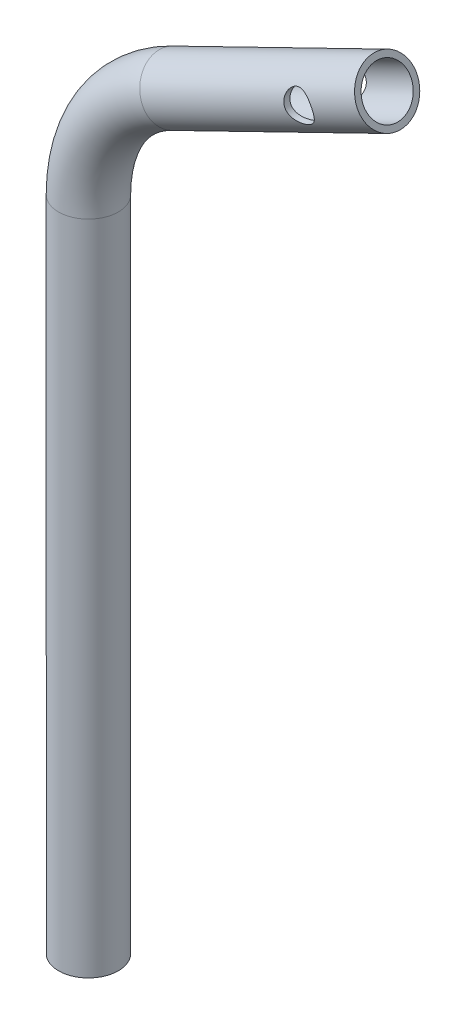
ISO-10303-21;
HEADER;
FILE_DESCRIPTION(('STEP AP214'),'2;1');
FILE_NAME('part.step','',(''),(''),'','','');
FILE_SCHEMA(('AUTOMOTIVE_DESIGN { 1 0 10303 214 1 1 1 1 }'));
ENDSEC;
DATA;
#1=APPLICATION_CONTEXT('core data for automotive mechanical design processes');
#2=APPLICATION_PROTOCOL_DEFINITION('international standard','automotive_design',2000,#1);
#3=PRODUCT_CONTEXT('',#1,'mechanical');
#4=PRODUCT('Part','Part','',(#3));
#5=PRODUCT_RELATED_PRODUCT_CATEGORY('part','',(#4));
#6=PRODUCT_DEFINITION_FORMATION('','',#4);
#7=PRODUCT_DEFINITION_CONTEXT('part definition',#1,'design');
#8=PRODUCT_DEFINITION('design','',#6,#7);
#9=PRODUCT_DEFINITION_SHAPE('','',#8);
#10=(LENGTH_UNIT() NAMED_UNIT(*) SI_UNIT(.MILLI.,.METRE.));
#11=(NAMED_UNIT(*) PLANE_ANGLE_UNIT() SI_UNIT($,.RADIAN.));
#12=(NAMED_UNIT(*) SI_UNIT($,.STERADIAN.) SOLID_ANGLE_UNIT());
#13=UNCERTAINTY_MEASURE_WITH_UNIT(LENGTH_MEASURE(1.E-05),#10,'distance_accuracy_value','');
#14=(GEOMETRIC_REPRESENTATION_CONTEXT(3) GLOBAL_UNCERTAINTY_ASSIGNED_CONTEXT((#13)) GLOBAL_UNIT_ASSIGNED_CONTEXT((#10,
#11,#12)) REPRESENTATION_CONTEXT('',''));
#15=CARTESIAN_POINT('',(0.,0.,0.));
#16=DIRECTION('',(0.,0.,1.));
#17=DIRECTION('',(1.,0.,0.));
#18=AXIS2_PLACEMENT_3D('',#15,#16,#17);
#19=CARTESIAN_POINT('',(28.0898876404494,264.943820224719,0.));
#20=DIRECTION('',(0.898876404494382,0.438202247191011,0.));
#21=DIRECTION('',(-0.438202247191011,0.898876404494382,0.));
#22=AXIS2_PLACEMENT_3D('',#19,#20,#21);
#23=CYLINDRICAL_SURFACE('',#22,10.);
#24=CARTESIAN_POINT('',(84.7191011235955,292.550561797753,-10.));
#25=CARTESIAN_POINT('',(84.7767194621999,292.43236934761,-9.99999960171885));
#26=CARTESIAN_POINT('',(84.829674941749,292.311893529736,-9.99740053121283));
#27=CARTESIAN_POINT('',(84.9258801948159,292.06728786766,-9.98706977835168));
#28=CARTESIAN_POINT('',(84.96912573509,291.943156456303,-9.97933586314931));
#29=CARTESIAN_POINT('',(85.0456773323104,291.692071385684,-9.95892066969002));
#30=CARTESIAN_POINT('',(85.0789690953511,291.565113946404,-9.94623233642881));
#31=CARTESIAN_POINT('',(85.1354042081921,291.309455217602,-9.91622716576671));
#32=CARTESIAN_POINT('',(85.1585433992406,291.180753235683,-9.89890843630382));
#33=CARTESIAN_POINT('',(85.19455126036,290.923118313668,-9.86015430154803));
#34=CARTESIAN_POINT('',(85.2074640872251,290.794188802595,-9.83873709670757));
#35=CARTESIAN_POINT('',(85.2232632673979,290.536358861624,-9.79224427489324));
#36=CARTESIAN_POINT('',(85.2261458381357,290.407458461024,-9.7671672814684));
#37=CARTESIAN_POINT('',(85.2199194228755,290.022109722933,-9.68730860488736));
#38=CARTESIAN_POINT('',(85.1959751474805,289.766729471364,-9.62785460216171));
#39=CARTESIAN_POINT('',(85.1073844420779,289.249291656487,-9.49780663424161));
#40=CARTESIAN_POINT('',(85.0403632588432,288.987764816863,-9.42675632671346));
#41=CARTESIAN_POINT('',(84.8654409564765,288.479084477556,-9.28300214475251));
#42=CARTESIAN_POINT('',(84.7575088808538,288.231942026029,-9.2102970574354));
#43=CARTESIAN_POINT('',(84.4924388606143,287.738323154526,-9.06493867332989));
#44=CARTESIAN_POINT('',(84.3321341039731,287.493384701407,-8.99272664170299));
#45=CARTESIAN_POINT('',(84.0598726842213,287.14814049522,-8.89637417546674));
#46=CARTESIAN_POINT('',(83.9637803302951,287.036719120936,-8.86624279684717));
#47=CARTESIAN_POINT('',(83.7614600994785,286.822155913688,-8.81109611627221));
#48=CARTESIAN_POINT('',(83.655238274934,286.719009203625,-8.78607778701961));
#49=CARTESIAN_POINT('',(83.4399209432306,286.527845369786,-8.74350562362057));
#50=CARTESIAN_POINT('',(83.3313696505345,286.439293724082,-8.72559704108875));
#51=CARTESIAN_POINT('',(83.1067106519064,286.271301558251,-8.69596333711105));
#52=CARTESIAN_POINT('',(82.9906069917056,286.191856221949,-8.6842349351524));
#53=CARTESIAN_POINT('',(82.7518296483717,286.042896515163,-8.66746161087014));
#54=CARTESIAN_POINT('',(82.6291599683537,285.973376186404,-8.66241266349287));
#55=CARTESIAN_POINT('',(82.3783175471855,285.844922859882,-8.65921299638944));
#56=CARTESIAN_POINT('',(82.2501453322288,285.785988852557,-8.66106161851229));
#57=CARTESIAN_POINT('',(82.0051750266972,285.685650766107,-8.67093727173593));
#58=CARTESIAN_POINT('',(81.8888566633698,285.642991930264,-8.6781966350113));
#59=CARTESIAN_POINT('',(81.6537249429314,285.566510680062,-8.69773906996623));
#60=CARTESIAN_POINT('',(81.5349108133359,285.532691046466,-8.71002371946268));
#61=CARTESIAN_POINT('',(81.2956620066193,285.474036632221,-8.73921479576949));
#62=CARTESIAN_POINT('',(81.1752275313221,285.449200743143,-8.7561206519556));
#63=CARTESIAN_POINT('',(80.933472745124,285.408518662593,-8.79403073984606));
#64=CARTESIAN_POINT('',(80.8121521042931,285.392676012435,-8.81503658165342));
#65=CARTESIAN_POINT('',(80.4423800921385,285.358076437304,-8.88436032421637));
#66=CARTESIAN_POINT('',(80.1935051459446,285.353561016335,-8.93828791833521));
#67=CARTESIAN_POINT('',(79.7000655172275,285.381001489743,-9.05517433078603));
#68=CARTESIAN_POINT('',(79.4555028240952,285.412973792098,-9.11813720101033));
#69=CARTESIAN_POINT('',(78.9440038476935,285.518443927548,-9.2556545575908));
#70=CARTESIAN_POINT('',(78.6781626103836,285.596693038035,-9.33066654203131));
#71=CARTESIAN_POINT('',(78.161970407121,285.79648099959,-9.47739013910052));
#72=CARTESIAN_POINT('',(77.9116268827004,285.918040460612,-9.54910016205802));
#73=CARTESIAN_POINT('',(77.5468838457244,286.134565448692,-9.65034506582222));
#74=CARTESIAN_POINT('',(77.4245114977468,286.214634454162,-9.68370380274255));
#75=CARTESIAN_POINT('',(77.1866410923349,286.385696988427,-9.74663052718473));
#76=CARTESIAN_POINT('',(77.0711401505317,286.476685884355,-9.77620011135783));
#77=CARTESIAN_POINT('',(76.8480402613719,286.669058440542,-9.83067553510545));
#78=CARTESIAN_POINT('',(76.7404381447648,286.770437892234,-9.85558325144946));
#79=CARTESIAN_POINT('',(76.5341187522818,286.982955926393,-9.89999026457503));
#80=CARTESIAN_POINT('',(76.4354004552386,287.0940933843,-9.91949018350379));
#81=CARTESIAN_POINT('',(76.2556453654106,287.315689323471,-9.95109597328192));
#82=CARTESIAN_POINT('',(76.1738213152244,287.425441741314,-9.96368046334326));
#83=CARTESIAN_POINT('',(76.0192589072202,287.651624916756,-9.98343035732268));
#84=CARTESIAN_POINT('',(75.9465197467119,287.768055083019,-9.99059624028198));
#85=CARTESIAN_POINT('',(75.8108153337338,288.006620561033,-9.99930380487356));
#86=CARTESIAN_POINT('',(75.7478463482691,288.12875367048,-10.000847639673));
#87=CARTESIAN_POINT('',(75.6321976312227,288.377736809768,-9.99827237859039));
#88=CARTESIAN_POINT('',(75.5795174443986,288.504586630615,-9.99415353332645));
#89=CARTESIAN_POINT('',(75.4885354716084,288.751896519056,-9.98090973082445));
#90=CARTESIAN_POINT('',(75.4494338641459,288.872085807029,-9.97219922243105));
#91=CARTESIAN_POINT('',(75.3805122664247,289.114731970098,-9.95027227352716));
#92=CARTESIAN_POINT('',(75.3506952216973,289.237189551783,-9.93705440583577));
#93=CARTESIAN_POINT('',(75.30046758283,289.48346236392,-9.90642450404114));
#94=CARTESIAN_POINT('',(75.2800541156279,289.607277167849,-9.88901375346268));
#95=CARTESIAN_POINT('',(75.2486129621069,289.855519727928,-9.85039368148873));
#96=CARTESIAN_POINT('',(75.2375888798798,289.979947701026,-9.82918290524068));
#97=CARTESIAN_POINT('',(75.2181796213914,290.360025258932,-9.7592287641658));
#98=CARTESIAN_POINT('',(75.2248521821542,290.615603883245,-9.70504904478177));
#99=CARTESIAN_POINT('',(75.276434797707,291.120496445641,-9.58719375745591));
#100=CARTESIAN_POINT('',(75.3213611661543,291.36980766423,-9.5235141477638));
#101=CARTESIAN_POINT('',(75.4540331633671,291.881779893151,-9.38541505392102));
#102=CARTESIAN_POINT('',(75.5455504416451,292.143347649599,-9.31055499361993));
#103=CARTESIAN_POINT('',(75.7709065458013,292.648670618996,-9.16310881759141));
#104=CARTESIAN_POINT('',(75.904774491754,292.892413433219,-9.0905243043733));
#105=CARTESIAN_POINT('',(76.1392977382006,293.245842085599,-8.98785260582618));
#106=CARTESIAN_POINT('',(76.2255127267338,293.364197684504,-8.95395955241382));
#107=CARTESIAN_POINT('',(76.4085782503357,293.593520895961,-8.89022352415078));
#108=CARTESIAN_POINT('',(76.5054239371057,293.704491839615,-8.86037871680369));
#109=CARTESIAN_POINT('',(76.7091652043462,293.918011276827,-8.80590327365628));
#110=CARTESIAN_POINT('',(76.8160524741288,294.020566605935,-8.78126837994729));
#111=CARTESIAN_POINT('',(77.0392351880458,294.216325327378,-8.73822819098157));
#112=CARTESIAN_POINT('',(77.155529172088,294.309530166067,-8.7198219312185));
#113=CARTESIAN_POINT('',(77.3850022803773,294.477100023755,-8.69151275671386));
#114=CARTESIAN_POINT('',(77.4974091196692,294.552414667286,-8.6809632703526));
#115=CARTESIAN_POINT('',(77.7282607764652,294.693833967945,-8.66606824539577));
#116=CARTESIAN_POINT('',(77.8467049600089,294.759939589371,-8.66172205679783));
#117=CARTESIAN_POINT('',(78.0885822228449,294.882302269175,-8.65941425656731));
#118=CARTESIAN_POINT('',(78.2120135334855,294.938562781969,-8.66145040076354));
#119=CARTESIAN_POINT('',(78.4628043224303,295.040788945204,-8.67181681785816));
#120=CARTESIAN_POINT('',(78.5901636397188,295.086755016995,-8.68014683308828));
#121=CARTESIAN_POINT('',(78.8353765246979,295.164198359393,-8.70167828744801));
#122=CARTESIAN_POINT('',(78.9529744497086,295.19664081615,-8.71433770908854));
#123=CARTESIAN_POINT('',(79.1896976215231,295.252765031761,-8.74411599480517));
#124=CARTESIAN_POINT('',(79.308823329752,295.276444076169,-8.76123623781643));
#125=CARTESIAN_POINT('',(79.6673387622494,295.334269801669,-8.81854231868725));
#126=CARTESIAN_POINT('',(79.9080213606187,295.35525342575,-8.8646881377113));
#127=CARTESIAN_POINT('',(80.4034722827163,295.362909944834,-8.97142890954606));
#128=CARTESIAN_POINT('',(80.6581005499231,295.3471829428,-9.03278633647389));
#129=CARTESIAN_POINT('',(81.1605585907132,295.277736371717,-9.1617663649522));
#130=CARTESIAN_POINT('',(81.4083847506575,295.223996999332,-9.22939221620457));
#131=CARTESIAN_POINT('',(81.9225455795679,295.071009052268,-9.3731144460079));
#132=CARTESIAN_POINT('',(82.1874702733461,294.967024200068,-9.44924162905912));
#133=CARTESIAN_POINT('',(82.6978464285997,294.714385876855,-9.59389514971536));
#134=CARTESIAN_POINT('',(82.9432873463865,294.565708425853,-9.66241737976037));
#135=CARTESIAN_POINT('',(83.2920945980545,294.310783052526,-9.75419013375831));
#136=CARTESIAN_POINT('',(83.4055664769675,294.220047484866,-9.78304209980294));
#137=CARTESIAN_POINT('',(83.6247536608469,294.028462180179,-9.83614745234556));
#138=CARTESIAN_POINT('',(83.7304727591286,293.927617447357,-9.86040309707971));
#139=CARTESIAN_POINT('',(83.9329497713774,293.716686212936,-9.90354484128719));
#140=CARTESIAN_POINT('',(84.0297269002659,293.606620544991,-9.92244264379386));
#141=CARTESIAN_POINT('',(84.2135590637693,293.377936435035,-9.95434618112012));
#142=CARTESIAN_POINT('',(84.3006200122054,293.259323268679,-9.96735551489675));
#143=CARTESIAN_POINT('',(84.4449363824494,293.043290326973,-9.98476387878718));
#144=CARTESIAN_POINT('',(84.5043902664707,292.947433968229,-9.99046741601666));
#145=CARTESIAN_POINT('',(84.6167419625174,292.751799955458,-9.99808569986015));
#146=CARTESIAN_POINT('',(84.6696395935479,292.652022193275,-10.000000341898));
#147=CARTESIAN_POINT('',(84.7191011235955,292.550561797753,-10.));
#148=B_SPLINE_CURVE_WITH_KNOTS('',3,(#24,#25,#26,#27,#28,#29,#30,#31,#32,#33,#34,#35,#36,#37,
#38,#39,#40,#41,#42,#43,#44,#45,#46,#47,#48,#49,#50,#51,#52,#53,#54,#55,#56,#57,#58,#59,#60,#61,
#62,#63,#64,#65,#66,#67,#68,#69,#70,#71,#72,#73,#74,#75,#76,#77,#78,#79,#80,#81,#82,#83,#84,#85,
#86,#87,#88,#89,#90,#91,#92,#93,#94,#95,#96,#97,#98,#99,#100,#101,#102,#103,#104,#105,#106,#107,
#108,#109,#110,#111,#112,#113,#114,#115,#116,#117,#118,#119,#120,#121,#122,#123,#124,#125,#126,
#127,#128,#129,#130,#131,#132,#133,#134,#135,#136,#137,#138,#139,#140,#141,#142,#143,#144,#145,
#146,#147),.UNSPECIFIED.,.T.,.F.,(4,2,2,2,2,2,2,2,2,2,2,2,2,2,2,2,2,2,2,2,2,2,2,2,2,2,2,2,2,2,2,
2,2,2,2,2,2,2,2,2,2,2,2,2,2,2,2,2,2,2,2,2,2,2,2,2,2,2,2,2,2,4),(0.,0.394355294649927,
0.788882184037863,1.18397293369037,1.57922537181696,1.97276168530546,2.3664463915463,
3.15295441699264,3.98704440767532,4.82176680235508,5.72122193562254,6.17125359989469,
6.62101803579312,7.04410338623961,7.46696393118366,7.88956954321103,8.31213483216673,
8.68401534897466,9.05601271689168,9.42796417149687,9.80006198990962,10.5608338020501,
11.3219478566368,12.1795688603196,13.03759852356,13.4870830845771,13.9363776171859,
14.3854908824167,14.8345524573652,15.2464230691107,15.6582572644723,16.0699337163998,
16.4815919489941,16.8612200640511,17.240968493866,17.6206008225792,18.0003788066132,
18.7808755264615,19.5617052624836,20.419213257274,21.2773121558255,21.7277011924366,
22.1778856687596,22.6277007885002,23.0774462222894,23.484026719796,23.8905646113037,
24.2969595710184,24.7033378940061,25.0708552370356,25.4384863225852,26.17326624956,
26.9574126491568,27.7419678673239,28.6218519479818,29.5022089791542,29.9460734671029,
30.3897193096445,30.8323885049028,31.2747867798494,31.6133053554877,31.9518332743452),.UNSPECIFIED.);
#149=CARTESIAN_POINT('',(84.7191011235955,292.550561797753,-10.));
#150=VERTEX_POINT('',#149);
#151=EDGE_CURVE('E76',#150,#150,#148,.T.);
#152=ORIENTED_EDGE('',*,*,#151,.F.);
#153=EDGE_LOOP('',(#152));
#154=FACE_BOUND('',#153,.T.);
#155=CARTESIAN_POINT('',(85.2247191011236,290.359550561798,9.75702156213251));
#156=CARTESIAN_POINT('',(85.2247095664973,290.613845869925,9.80834342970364));
#157=CARTESIAN_POINT('',(85.205269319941,290.869586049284,9.85339160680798));
#158=CARTESIAN_POINT('',(85.1267380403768,291.377529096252,9.926794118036));
#159=CARTESIAN_POINT('',(85.0676279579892,291.629730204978,9.95514041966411));
#160=CARTESIAN_POINT('',(84.9103046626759,292.123805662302,9.99238574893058));
#161=CARTESIAN_POINT('',(84.8120103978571,292.365657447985,10.0012442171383));
#162=CARTESIAN_POINT('',(84.5790149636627,292.830945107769,9.99847224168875));
#163=CARTESIAN_POINT('',(84.4443212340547,293.054384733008,9.9868459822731));
#164=CARTESIAN_POINT('',(84.1475205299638,293.470000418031,9.94495903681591));
#165=CARTESIAN_POINT('',(83.98636355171,293.662916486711,9.91527131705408));
#166=CARTESIAN_POINT('',(83.6388311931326,294.020990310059,9.84049056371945));
#167=CARTESIAN_POINT('',(83.4524499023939,294.186141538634,9.79539391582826));
#168=CARTESIAN_POINT('',(83.0494736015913,294.493335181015,9.691049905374));
#169=CARTESIAN_POINT('',(82.8318286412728,294.633791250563,9.6312033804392));
#170=CARTESIAN_POINT('',(82.3792344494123,294.878883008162,9.50393257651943));
#171=CARTESIAN_POINT('',(82.1442759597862,294.983499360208,9.43650423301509));
#172=CARTESIAN_POINT('',(81.6375864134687,295.164048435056,9.29298866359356));
#173=CARTESIAN_POINT('',(81.3645222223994,295.236093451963,9.21670723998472));
#174=CARTESIAN_POINT('',(80.808269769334,295.333390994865,9.07002524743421));
#175=CARTESIAN_POINT('',(80.5250771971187,295.358623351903,8.99962722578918));
#176=CARTESIAN_POINT('',(80.0950465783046,295.359986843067,8.90438740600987));
#177=CARTESIAN_POINT('',(79.9492915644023,295.354102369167,8.87410940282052));
#178=CARTESIAN_POINT('',(79.6579480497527,295.329470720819,8.81848577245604));
#179=CARTESIAN_POINT('',(79.5123595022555,295.3107299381,8.7931377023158));
#180=CARTESIAN_POINT('',(79.2226557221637,295.260312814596,8.74843200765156));
#181=CARTESIAN_POINT('',(79.0785391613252,295.228649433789,8.72906841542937));
#182=CARTESIAN_POINT('',(78.7929767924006,295.152455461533,8.69716627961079));
#183=CARTESIAN_POINT('',(78.6515305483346,295.107926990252,8.6846266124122));
#184=CARTESIAN_POINT('',(78.3889277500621,295.01219269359,8.66799166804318));
#185=CARTESIAN_POINT('',(78.2673200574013,294.962359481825,8.66308594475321));
#186=CARTESIAN_POINT('',(78.0283338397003,294.853228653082,8.65926051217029));
#187=CARTESIAN_POINT('',(77.9109550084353,294.793931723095,8.66034036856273));
#188=CARTESIAN_POINT('',(77.68139992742,294.66637882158,8.66844378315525));
#189=CARTESIAN_POINT('',(77.5692233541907,294.598123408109,8.67546697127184));
#190=CARTESIAN_POINT('',(77.350929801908,294.453264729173,8.6951847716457));
#191=CARTESIAN_POINT('',(77.2448127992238,294.376661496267,8.70787936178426));
#192=CARTESIAN_POINT('',(77.0461848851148,294.22112513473,8.73745617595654));
#193=CARTESIAN_POINT('',(76.953238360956,294.142683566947,8.75400478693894));
#194=CARTESIAN_POINT('',(76.7737195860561,293.979677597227,8.79113421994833));
#195=CARTESIAN_POINT('',(76.6871494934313,293.895111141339,8.81171639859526));
#196=CARTESIAN_POINT('',(76.4376353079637,293.63309524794,8.8786547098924));
#197=CARTESIAN_POINT('',(76.2847636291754,293.447231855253,8.93022227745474));
#198=CARTESIAN_POINT('',(75.9951402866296,293.038951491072,9.04742769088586));
#199=CARTESIAN_POINT('',(75.8612938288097,292.814739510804,9.11393626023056));
#200=CARTESIAN_POINT('',(75.6302613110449,292.349171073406,9.25077256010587));
#201=CARTESIAN_POINT('',(75.5330988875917,292.10780368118,9.32110271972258));
#202=CARTESIAN_POINT('',(75.3687541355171,291.585246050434,9.46671719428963));
#203=CARTESIAN_POINT('',(75.3059353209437,291.302568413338,9.54171776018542));
#204=CARTESIAN_POINT('',(75.2489194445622,290.871874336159,9.64579855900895));
#205=CARTESIAN_POINT('',(75.2361194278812,290.727115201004,9.67910482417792));
#206=CARTESIAN_POINT('',(75.2231923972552,290.436254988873,9.74201512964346));
#207=CARTESIAN_POINT('',(75.2230589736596,290.290154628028,9.77162103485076));
#208=CARTESIAN_POINT('',(75.2355312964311,290.001196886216,9.82561919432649));
#209=CARTESIAN_POINT('',(75.2478292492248,289.858346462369,9.85012015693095));
#210=CARTESIAN_POINT('',(75.2848023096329,289.573530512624,9.89407884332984));
#211=CARTESIAN_POINT('',(75.3094713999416,289.431564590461,9.91353901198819));
#212=CARTESIAN_POINT('',(75.3711490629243,289.14973392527,9.94684010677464));
#213=CARTESIAN_POINT('',(75.4081516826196,289.009868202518,9.96068373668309));
#214=CARTESIAN_POINT('',(75.4943107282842,288.733455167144,9.98233448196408));
#215=CARTESIAN_POINT('',(75.5434658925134,288.596907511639,9.99014222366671));
#216=CARTESIAN_POINT('',(75.648010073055,288.341936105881,9.99900715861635));
#217=CARTESIAN_POINT('',(75.7022751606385,288.223070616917,10.0006642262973));
#218=CARTESIAN_POINT('',(75.8199478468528,287.989942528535,9.99885627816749));
#219=CARTESIAN_POINT('',(75.8833584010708,287.875681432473,9.99538960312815));
#220=CARTESIAN_POINT('',(76.0187624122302,287.652719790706,9.98342334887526));
#221=CARTESIAN_POINT('',(76.0907517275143,287.544016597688,9.974926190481));
#222=CARTESIAN_POINT('',(76.2427667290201,287.332837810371,9.9531150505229));
#223=CARTESIAN_POINT('',(76.3227954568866,287.230364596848,9.93979924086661));
#224=CARTESIAN_POINT('',(76.4876666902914,287.035360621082,9.90915505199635));
#225=CARTESIAN_POINT('',(76.5722888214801,286.942622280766,9.89196099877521));
#226=CARTESIAN_POINT('',(76.7478344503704,286.764141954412,9.85374876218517));
#227=CARTESIAN_POINT('',(76.8387601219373,286.678402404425,9.83272925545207));
#228=CARTESIAN_POINT('',(77.1200122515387,286.432370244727,9.76461011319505));
#229=CARTESIAN_POINT('',(77.3189382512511,286.28311780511,9.71242577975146));
#230=CARTESIAN_POINT('',(77.749870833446,286.006916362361,9.5946585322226));
#231=CARTESIAN_POINT('',(77.9832332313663,285.882402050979,9.52837415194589));
#232=CARTESIAN_POINT('',(78.4655035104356,285.671853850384,9.39107260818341));
#233=CARTESIAN_POINT('',(78.7144222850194,285.585847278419,9.32005212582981));
#234=CARTESIAN_POINT('',(79.2468446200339,285.447719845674,9.17319659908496));
#235=CARTESIAN_POINT('',(79.5314207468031,285.399454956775,9.09752148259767));
#236=CARTESIAN_POINT('',(79.9630848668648,285.364306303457,8.99233267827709));
#237=CARTESIAN_POINT('',(80.1078564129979,285.358805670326,8.95864030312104));
#238=CARTESIAN_POINT('',(80.3981593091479,285.360455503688,8.89516583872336));
#239=CARTESIAN_POINT('',(80.5436902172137,285.36759928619,8.86538169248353));
#240=CARTESIAN_POINT('',(80.8314799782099,285.394442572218,8.81139879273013));
#241=CARTESIAN_POINT('',(80.9737440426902,285.413878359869,8.78709692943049));
#242=CARTESIAN_POINT('',(81.256847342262,285.465126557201,8.74427677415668));
#243=CARTESIAN_POINT('',(81.3976872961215,285.496932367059,8.72575540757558));
#244=CARTESIAN_POINT('',(81.6766215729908,285.572813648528,8.69529270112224));
#245=CARTESIAN_POINT('',(81.814718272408,285.616877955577,8.68334540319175));
#246=CARTESIAN_POINT('',(82.0869296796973,285.717008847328,8.66655703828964));
#247=CARTESIAN_POINT('',(82.221044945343,285.773073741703,8.66171497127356));
#248=CARTESIAN_POINT('',(82.4672756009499,285.888863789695,8.65950994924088));
#249=CARTESIAN_POINT('',(82.5800268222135,285.947227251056,8.66127784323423));
#250=CARTESIAN_POINT('',(82.8006336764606,286.072273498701,8.67033676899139));
#251=CARTESIAN_POINT('',(82.9084877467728,286.138958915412,8.67762955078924));
#252=CARTESIAN_POINT('',(83.1184613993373,286.280059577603,8.69747956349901));
#253=CARTESIAN_POINT('',(83.2205825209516,286.354472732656,8.71003537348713));
#254=CARTESIAN_POINT('',(83.4184930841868,286.510432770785,8.73997475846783));
#255=CARTESIAN_POINT('',(83.5142800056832,286.591982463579,8.75736024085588));
#256=CARTESIAN_POINT('',(83.7873866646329,286.842802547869,8.81512319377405));
#257=CARTESIAN_POINT('',(83.955058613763,287.021369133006,8.8615867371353));
#258=CARTESIAN_POINT('',(84.2612594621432,287.398876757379,8.96590075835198));
#259=CARTESIAN_POINT('',(84.3997680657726,287.59783184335,9.023759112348));
#260=CARTESIAN_POINT('',(84.6607247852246,288.036925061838,9.15273559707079));
#261=CARTESIAN_POINT('',(84.7792989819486,288.279146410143,9.2246122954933));
#262=CARTESIAN_POINT('',(84.975992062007,288.779203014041,9.36857327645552));
#263=CARTESIAN_POINT('',(85.0541488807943,289.037023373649,9.44065730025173));
#264=CARTESIAN_POINT('',(85.1486997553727,289.473123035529,9.55470715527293));
#265=CARTESIAN_POINT('',(85.177079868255,289.64839419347,9.59853116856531));
#266=CARTESIAN_POINT('',(85.2150934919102,290.002054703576,9.68161490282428));
#267=CARTESIAN_POINT('',(85.2247258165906,290.180444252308,9.72087433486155));
#268=CARTESIAN_POINT('',(85.2247191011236,290.359550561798,9.75702156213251));
#269=B_SPLINE_CURVE_WITH_KNOTS('',3,(#155,#156,#157,#158,#159,#160,#161,#162,#163,#164,#165,
#166,#167,#168,#169,#170,#171,#172,#173,#174,#175,#176,#177,#178,#179,#180,#181,#182,#183,#184,
#185,#186,#187,#188,#189,#190,#191,#192,#193,#194,#195,#196,#197,#198,#199,#200,#201,#202,#203,
#204,#205,#206,#207,#208,#209,#210,#211,#212,#213,#214,#215,#216,#217,#218,#219,#220,#221,#222,
#223,#224,#225,#226,#227,#228,#229,#230,#231,#232,#233,#234,#235,#236,#237,#238,#239,#240,#241,
#242,#243,#244,#245,#246,#247,#248,#249,#250,#251,#252,#253,#254,#255,#256,#257,#258,#259,#260,
#261,#262,#263,#264,#265,#266,#267,#268),.UNSPECIFIED.,.T.,.F.,(4,2,2,2,2,2,2,2,2,2,2,2,2,2,2,2,
2,2,2,2,2,2,2,2,2,2,2,2,2,2,2,2,2,2,2,2,2,2,2,2,2,2,2,2,2,2,2,2,2,2,2,2,2,2,2,2,4),(0.,
0.777666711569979,1.55570712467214,2.33536532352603,3.1148642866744,3.87083838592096,
4.62698992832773,5.42129238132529,6.21602269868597,7.08979587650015,7.96394542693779,
8.4103680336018,8.85656885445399,9.30232327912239,9.74800428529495,10.142016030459,
10.535999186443,10.9299578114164,11.3239148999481,11.6917411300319,12.0596912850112,
12.795120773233,13.6003205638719,14.4060382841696,15.2986527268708,15.7454519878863,
16.1920251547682,16.627805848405,17.0633747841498,17.4987337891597,17.9340476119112,
18.3255868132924,18.7172528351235,19.1087305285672,19.5003568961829,19.880074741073,
20.2599241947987,21.0190489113,21.8337819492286,22.6490920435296,23.5395832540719,
23.9853350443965,24.4308512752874,24.8671192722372,25.3031548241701,25.7387945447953,
26.1743729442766,26.5548139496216,26.9353755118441,27.3158343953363,27.6964437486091,
28.4411030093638,29.186278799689,30.0201502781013,30.8532376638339,31.4009324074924,
31.948661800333),.UNSPECIFIED.);
#270=CARTESIAN_POINT('',(85.2247191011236,290.359550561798,9.75702156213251));
#271=VERTEX_POINT('',#270);
#272=EDGE_CURVE('E72',#271,#271,#269,.T.);
#273=ORIENTED_EDGE('',*,*,#272,.F.);
#274=EDGE_LOOP('',(#273));
#275=FACE_BOUND('',#274,.T.);
#276=CARTESIAN_POINT('',(28.0898876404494,264.943820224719,0.));
#277=DIRECTION('',(0.898876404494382,0.438202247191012,0.));
#278=DIRECTION('',(0.,0.,1.));
#279=AXIS2_PLACEMENT_3D('',#276,#277,#278);
#280=CIRCLE('',#279,10.);
#281=CARTESIAN_POINT('',(23.7078651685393,273.932584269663,0.));
#282=VERTEX_POINT('',#281);
#283=EDGE_CURVE('E49',#282,#282,#280,.T.);
#284=ORIENTED_EDGE('',*,*,#283,.T.);
#285=EDGE_LOOP('',(#284));
#286=FACE_BOUND('',#285,.T.);
#287=CARTESIAN_POINT('',(100.,300.,0.));
#288=DIRECTION('',(0.898876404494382,0.438202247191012,0.));
#289=DIRECTION('',(0.,0.,1.));
#290=AXIS2_PLACEMENT_3D('',#287,#288,#289);
#291=CIRCLE('',#290,10.);
#292=CARTESIAN_POINT('',(100.,300.,10.));
#293=VERTEX_POINT('',#292);
#294=EDGE_CURVE('E10',#293,#293,#291,.T.);
#295=ORIENTED_EDGE('',*,*,#294,.F.);
#296=EDGE_LOOP('',(#295));
#297=FACE_BOUND('',#296,.T.);
#298=ADVANCED_FACE('F33',(#154,#275,#286,#297),#23,.T.);
#299=CARTESIAN_POINT('',(28.0898876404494,264.943820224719,0.));
#300=DIRECTION('',(0.898876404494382,0.438202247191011,0.));
#301=DIRECTION('',(-0.438202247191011,0.898876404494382,0.));
#302=AXIS2_PLACEMENT_3D('',#299,#300,#301);
#303=CYLINDRICAL_SURFACE('',#302,8.);
#304=CARTESIAN_POINT('',(85.2247191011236,290.359550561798,-7.6941191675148));
#305=CARTESIAN_POINT('',(85.2247182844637,290.21267086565,-7.6565217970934));
#306=CARTESIAN_POINT('',(85.2182415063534,290.066435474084,-7.61621838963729));
#307=CARTESIAN_POINT('',(85.1927186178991,289.776263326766,-7.53129702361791));
#308=CARTESIAN_POINT('',(85.1736630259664,289.632328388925,-7.48667583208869));
#309=CARTESIAN_POINT('',(85.1233013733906,289.34716703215,-7.3941356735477));
#310=CARTESIAN_POINT('',(85.0919554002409,289.205951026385,-7.34620638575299));
#311=CARTESIAN_POINT('',(85.017390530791,288.927384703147,-7.24838580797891));
#312=CARTESIAN_POINT('',(84.9741703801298,288.790034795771,-7.19849431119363));
#313=CARTESIAN_POINT('',(84.8763309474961,288.520252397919,-7.0981799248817));
#314=CARTESIAN_POINT('',(84.8217519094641,288.387804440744,-7.04775949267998));
#315=CARTESIAN_POINT('',(84.7013671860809,288.127927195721,-6.94756175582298));
#316=CARTESIAN_POINT('',(84.6355620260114,288.0004976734,-6.89778442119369));
#317=CARTESIAN_POINT('',(84.4217040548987,287.626870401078,-6.75161500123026));
#318=CARTESIAN_POINT('',(84.2569790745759,287.3886995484,-6.65813872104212));
#319=CARTESIAN_POINT('',(83.9202973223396,286.983456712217,-6.50794639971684));
#320=CARTESIAN_POINT('',(83.7558306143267,286.811522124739,-6.44761796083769));
#321=CARTESIAN_POINT('',(83.4895300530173,286.570704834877,-6.37270811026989));
#322=CARTESIAN_POINT('',(83.3975054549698,286.493285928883,-6.35033658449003));
#323=CARTESIAN_POINT('',(83.2073352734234,286.34476071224,-6.31157928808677));
#324=CARTESIAN_POINT('',(83.1091924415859,286.273651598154,-6.29519084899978));
#325=CARTESIAN_POINT('',(82.9066639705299,286.137923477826,-6.26897106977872));
#326=CARTESIAN_POINT('',(82.8022395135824,286.073353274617,-6.25918633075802));
#327=CARTESIAN_POINT('',(82.588589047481,285.951918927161,-6.24679141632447));
#328=CARTESIAN_POINT('',(82.4793630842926,285.895054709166,-6.24418117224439));
#329=CARTESIAN_POINT('',(82.2570540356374,285.789567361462,-6.24626008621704));
#330=CARTESIAN_POINT('',(82.143970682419,285.740944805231,-6.25094975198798));
#331=CARTESIAN_POINT('',(81.9150138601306,285.652322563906,-6.26739973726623));
#332=CARTESIAN_POINT('',(81.7991404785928,285.612322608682,-6.2791598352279));
#333=CARTESIAN_POINT('',(81.4719694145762,285.51263290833,-6.32134363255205));
#334=CARTESIAN_POINT('',(81.2585249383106,285.462807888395,-6.3591716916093));
#335=CARTESIAN_POINT('',(80.8307165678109,285.391657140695,-6.45157516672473));
#336=CARTESIAN_POINT('',(80.6163522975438,285.370344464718,-6.5061582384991));
#337=CARTESIAN_POINT('',(80.1625975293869,285.354150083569,-6.63439545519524));
#338=CARTESIAN_POINT('',(79.9235155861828,285.363000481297,-6.70959636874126));
#339=CARTESIAN_POINT('',(79.4513722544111,285.414001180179,-6.86720052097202));
#340=CARTESIAN_POINT('',(79.2183157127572,285.456177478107,-6.94960933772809));
#341=CARTESIAN_POINT('',(78.7134921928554,285.584915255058,-7.13231000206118));
#342=CARTESIAN_POINT('',(78.4436002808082,285.678811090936,-7.2328000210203));
#343=CARTESIAN_POINT('',(78.0519235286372,285.854056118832,-7.37687946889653));
#344=CARTESIAN_POINT('',(77.9234599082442,285.918270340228,-7.42383184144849));
#345=CARTESIAN_POINT('',(77.6716691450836,286.058080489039,-7.51437773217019));
#346=CARTESIAN_POINT('',(77.5483394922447,286.13367076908,-7.55797290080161));
#347=CARTESIAN_POINT('',(77.3053111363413,286.297658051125,-7.6415020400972));
#348=CARTESIAN_POINT('',(77.185732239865,286.386278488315,-7.68134670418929));
#349=CARTESIAN_POINT('',(76.9539632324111,286.574785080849,-7.75523029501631));
#350=CARTESIAN_POINT('',(76.8417692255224,286.674665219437,-7.78927229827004));
#351=CARTESIAN_POINT('',(76.6260152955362,286.885070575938,-7.85050290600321));
#352=CARTESIAN_POINT('',(76.5224466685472,286.995584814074,-7.8776984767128));
#353=CARTESIAN_POINT('',(76.325082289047,287.226518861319,-7.92438373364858));
#354=CARTESIAN_POINT('',(76.2312844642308,287.346936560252,-7.94387505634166));
#355=CARTESIAN_POINT('',(76.0674253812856,287.57853780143,-7.97227064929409));
#356=CARTESIAN_POINT('',(75.9958920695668,287.688546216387,-7.98229681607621));
#357=CARTESIAN_POINT('',(75.8615540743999,287.914142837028,-7.99595269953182));
#358=CARTESIAN_POINT('',(75.7987483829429,288.02973039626,-7.99958315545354));
#359=CARTESIAN_POINT('',(75.6824595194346,288.265475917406,-8.00034887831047));
#360=CARTESIAN_POINT('',(75.628973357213,288.385632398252,-7.99748623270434));
#361=CARTESIAN_POINT('',(75.5317291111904,288.629499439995,-7.98534882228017));
#362=CARTESIAN_POINT('',(75.4879707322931,288.753209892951,-7.97607425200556));
#363=CARTESIAN_POINT('',(75.4138762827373,288.992066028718,-7.95245342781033));
#364=CARTESIAN_POINT('',(75.3826957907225,289.107002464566,-7.93862780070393));
#365=CARTESIAN_POINT('',(75.3287124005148,289.338165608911,-7.90615669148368));
#366=CARTESIAN_POINT('',(75.305912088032,289.454392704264,-7.88750972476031));
#367=CARTESIAN_POINT('',(75.2501170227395,289.803803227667,-7.82489489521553));
#368=CARTESIAN_POINT('',(75.2296675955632,290.037913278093,-7.77423266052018));
#369=CARTESIAN_POINT('',(75.221097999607,290.517568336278,-7.65529542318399));
#370=CARTESIAN_POINT('',(75.235077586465,290.762913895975,-7.58611774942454));
#371=CARTESIAN_POINT('',(75.2978708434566,291.245850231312,-7.43714903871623));
#372=CARTESIAN_POINT('',(75.3467092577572,291.483435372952,-7.35735049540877));
#373=CARTESIAN_POINT('',(75.4869842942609,291.981334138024,-7.18074692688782));
#374=CARTESIAN_POINT('',(75.5835893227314,292.23991800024,-7.08315775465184));
#375=CARTESIAN_POINT('',(75.8183506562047,292.738616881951,-6.89052730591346));
#376=CARTESIAN_POINT('',(75.956519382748,292.978726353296,-6.79548680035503));
#377=CARTESIAN_POINT('',(76.2560689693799,293.41093773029,-6.62824018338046));
#378=CARTESIAN_POINT('',(76.4132076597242,293.605413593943,-6.55467167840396));
#379=CARTESIAN_POINT('',(76.6719880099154,293.880053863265,-6.45850005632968));
#380=CARTESIAN_POINT('',(76.7620903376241,293.96875252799,-6.42880707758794));
#381=CARTESIAN_POINT('',(76.9496980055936,294.139805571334,-6.37519481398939));
#382=CARTESIAN_POINT('',(77.0471996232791,294.222163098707,-6.35127265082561));
#383=CARTESIAN_POINT('',(77.2501162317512,294.38055345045,-6.3099752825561));
#384=CARTESIAN_POINT('',(77.3555990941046,294.456516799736,-6.29266616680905));
#385=CARTESIAN_POINT('',(77.5728714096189,294.600384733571,-6.26573921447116));
#386=CARTESIAN_POINT('',(77.6846607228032,294.668289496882,-6.25612120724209));
#387=CARTESIAN_POINT('',(77.9134682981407,294.795226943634,-6.24506835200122));
#388=CARTESIAN_POINT('',(78.0304832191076,294.854265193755,-6.24362834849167));
#389=CARTESIAN_POINT('',(78.2686227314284,294.962898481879,-6.24899410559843));
#390=CARTESIAN_POINT('',(78.3897469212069,295.012494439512,-6.25579906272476));
#391=CARTESIAN_POINT('',(78.6169060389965,295.095301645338,-6.27572294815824));
#392=CARTESIAN_POINT('',(78.7225525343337,295.129848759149,-6.28777106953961));
#393=CARTESIAN_POINT('',(78.9352356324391,295.191683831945,-6.31717882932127));
#394=CARTESIAN_POINT('',(79.042272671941,295.218969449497,-6.33454017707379));
#395=CARTESIAN_POINT('',(79.3644751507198,295.289893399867,-6.39377734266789));
#396=CARTESIAN_POINT('',(79.5808145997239,295.322628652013,-6.44281424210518));
#397=CARTESIAN_POINT('',(80.0290255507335,295.361179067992,-6.55892745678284));
#398=CARTESIAN_POINT('',(80.2607897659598,295.364690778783,-6.62711397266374));
#399=CARTESIAN_POINT('',(80.7197028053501,295.340299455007,-6.77264220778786));
#400=CARTESIAN_POINT('',(80.9468489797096,295.312378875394,-6.84998901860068));
#401=CARTESIAN_POINT('',(81.4425383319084,295.216869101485,-7.02487229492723));
#402=CARTESIAN_POINT('',(81.7094669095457,295.142034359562,-7.12317066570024));
#403=CARTESIAN_POINT('',(82.0988575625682,294.997096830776,-7.26690037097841));
#404=CARTESIAN_POINT('',(82.2269174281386,294.943281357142,-7.31422649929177));
#405=CARTESIAN_POINT('',(82.4788414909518,294.824782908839,-7.4065927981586));
#406=CARTESIAN_POINT('',(82.6027050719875,294.760098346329,-7.45163263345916));
#407=CARTESIAN_POINT('',(82.8533907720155,294.615414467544,-7.54117249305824));
#408=CARTESIAN_POINT('',(82.9798771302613,294.53469050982,-7.58544483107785));
#409=CARTESIAN_POINT('',(83.2261189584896,294.361331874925,-7.66890522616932));
#410=CARTESIAN_POINT('',(83.3458776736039,294.268703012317,-7.70809574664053));
#411=CARTESIAN_POINT('',(83.5774457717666,294.071999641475,-7.78021436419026));
#412=CARTESIAN_POINT('',(83.6892627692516,293.967936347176,-7.8131485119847));
#413=CARTESIAN_POINT('',(83.9037847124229,293.748939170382,-7.87174025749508));
#414=CARTESIAN_POINT('',(84.0064915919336,293.634007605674,-7.89739940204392));
#415=CARTESIAN_POINT('',(84.188852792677,293.409754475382,-7.9377687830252));
#416=CARTESIAN_POINT('',(84.2697698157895,293.301635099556,-7.95346681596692));
#417=CARTESIAN_POINT('',(84.422886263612,293.078681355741,-7.97825752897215));
#418=CARTESIAN_POINT('',(84.4950869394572,292.963847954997,-7.98735115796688));
#419=CARTESIAN_POINT('',(84.6300288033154,292.728443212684,-7.99867393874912));
#420=CARTESIAN_POINT('',(84.6927709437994,292.607872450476,-8.00090378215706));
#421=CARTESIAN_POINT('',(84.8081978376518,292.362086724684,-7.99843549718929));
#422=CARTESIAN_POINT('',(84.8608835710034,292.236872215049,-7.99373804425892));
#423=CARTESIAN_POINT('',(84.9504331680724,291.997262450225,-7.97846679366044));
#424=CARTESIAN_POINT('',(84.9884101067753,291.883234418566,-7.96861339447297));
#425=CARTESIAN_POINT('',(85.0559523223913,291.653211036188,-7.9437771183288));
#426=CARTESIAN_POINT('',(85.0855141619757,291.537214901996,-7.92879215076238));
#427=CARTESIAN_POINT('',(85.1360920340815,291.304321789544,-7.89404974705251));
#428=CARTESIAN_POINT('',(85.1571238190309,291.187426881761,-7.87430121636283));
#429=CARTESIAN_POINT('',(85.1907542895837,290.953253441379,-7.83042001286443));
#430=CARTESIAN_POINT('',(85.203353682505,290.835974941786,-7.80628770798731));
#431=CARTESIAN_POINT('',(85.216117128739,290.65883310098,-7.76683458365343));
#432=CARTESIAN_POINT('',(85.219349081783,290.598850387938,-7.75295298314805));
#433=CARTESIAN_POINT('',(85.2236498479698,290.479059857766,-7.72423610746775));
#434=CARTESIAN_POINT('',(85.2247194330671,290.419251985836,-7.70940117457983));
#435=CARTESIAN_POINT('',(85.2247191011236,290.359550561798,-7.6941191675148));
#436=B_SPLINE_CURVE_WITH_KNOTS('',3,(#304,#305,#306,#307,#308,#309,#310,#311,#312,#313,#314,
#315,#316,#317,#318,#319,#320,#321,#322,#323,#324,#325,#326,#327,#328,#329,#330,#331,#332,#333,
#334,#335,#336,#337,#338,#339,#340,#341,#342,#343,#344,#345,#346,#347,#348,#349,#350,#351,#352,
#353,#354,#355,#356,#357,#358,#359,#360,#361,#362,#363,#364,#365,#366,#367,#368,#369,#370,#371,
#372,#373,#374,#375,#376,#377,#378,#379,#380,#381,#382,#383,#384,#385,#386,#387,#388,#389,#390,
#391,#392,#393,#394,#395,#396,#397,#398,#399,#400,#401,#402,#403,#404,#405,#406,#407,#408,#409,
#410,#411,#412,#413,#414,#415,#416,#417,#418,#419,#420,#421,#422,#423,#424,#425,#426,#427,#428,
#429,#430,#431,#432,#433,#434,#435),.UNSPECIFIED.,.T.,.F.,(4,2,2,2,2,2,2,2,2,2,2,2,2,2,2,2,2,2,
2,2,2,2,2,2,2,2,2,2,2,2,2,2,2,2,2,2,2,2,2,2,2,2,2,2,2,2,2,2,2,2,2,2,2,2,2,2,2,2,2,2,2,2,2,2,2,
4),(0.,0.454780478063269,0.909904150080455,1.3665182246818,1.82318055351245,2.27825168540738,
2.73330152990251,3.64127062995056,4.37453467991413,4.74110186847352,5.1075053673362,
5.47646820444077,5.84542751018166,6.21441247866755,6.58338588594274,7.24767608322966,
7.91227026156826,8.66192732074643,9.41216974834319,10.3164294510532,10.7692899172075,
11.2219263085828,11.6835016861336,12.1448315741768,12.6056901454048,13.0664507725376,
13.460719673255,13.8549429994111,14.2490396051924,14.6431242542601,15.0023827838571,
15.3617520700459,16.0798754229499,16.8428670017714,17.6064007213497,18.4811439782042,
19.3561489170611,20.1346261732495,20.5238404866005,20.9128602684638,21.3056720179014,
21.6984750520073,22.091030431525,22.4835475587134,22.8185722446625,23.1537048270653,
23.8237083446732,24.5460667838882,25.2688286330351,26.1471783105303,26.5870478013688,
27.0269816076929,27.4956692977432,27.9641289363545,28.4321331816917,28.9000378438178,
29.3073245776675,29.7145527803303,30.1217399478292,30.5288874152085,30.8902391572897,
31.2517382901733,31.6125667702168,31.9733649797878,32.1582832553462,32.3431355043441),.UNSPECIFIED.);
#437=CARTESIAN_POINT('',(85.2247191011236,290.359550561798,-7.6941191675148));
#438=VERTEX_POINT('',#437);
#439=EDGE_CURVE('E37',#438,#438,#436,.T.);
#440=ORIENTED_EDGE('',*,*,#439,.T.);
#441=EDGE_LOOP('',(#440));
#442=FACE_BOUND('',#441,.T.);
#443=CARTESIAN_POINT('',(85.2247191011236,290.359550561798,7.6941191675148));
#444=CARTESIAN_POINT('',(85.2247206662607,290.480363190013,7.72504497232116));
#445=CARTESIAN_POINT('',(85.2203401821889,290.601621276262,7.75414067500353));
#446=CARTESIAN_POINT('',(85.2026414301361,290.844413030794,7.80811706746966));
#447=CARTESIAN_POINT('',(85.1893255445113,290.965946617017,7.83299887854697));
#448=CARTESIAN_POINT('',(85.1536234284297,291.208642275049,7.8780462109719));
#449=CARTESIAN_POINT('',(85.1312314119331,291.329804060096,7.89820871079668));
#450=CARTESIAN_POINT('',(85.07735737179,291.570805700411,7.93334560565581));
#451=CARTESIAN_POINT('',(85.0458792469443,291.690646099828,7.94832221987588));
#452=CARTESIAN_POINT('',(84.973778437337,291.928610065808,7.97279683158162));
#453=CARTESIAN_POINT('',(84.9331223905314,292.046725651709,7.9822743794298));
#454=CARTESIAN_POINT('',(84.8429644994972,292.279815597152,7.99543293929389));
#455=CARTESIAN_POINT('',(84.7934659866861,292.394791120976,7.99911612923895));
#456=CARTESIAN_POINT('',(84.6859636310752,292.620733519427,8.00060178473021));
#457=CARTESIAN_POINT('',(84.6279598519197,292.731700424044,7.99840429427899));
#458=CARTESIAN_POINT('',(84.5039239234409,292.94876531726,7.98818360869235));
#459=CARTESIAN_POINT('',(84.4378919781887,293.054863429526,7.98016056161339));
#460=CARTESIAN_POINT('',(84.301367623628,293.25699105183,7.95894817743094));
#461=CARTESIAN_POINT('',(84.2311885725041,293.353257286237,7.94599551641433));
#462=CARTESIAN_POINT('',(84.084558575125,293.540079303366,7.91521700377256));
#463=CARTESIAN_POINT('',(84.0081055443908,293.630633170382,7.89738952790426));
#464=CARTESIAN_POINT('',(83.7702416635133,293.892944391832,7.83712612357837));
#465=CARTESIAN_POINT('',(83.6002233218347,294.055502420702,7.78789253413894));
#466=CARTESIAN_POINT('',(83.2318490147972,294.361791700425,7.67180895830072));
#467=CARTESIAN_POINT('',(83.0324237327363,294.503894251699,7.60410604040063));
#468=CARTESIAN_POINT('',(82.6180223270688,294.756255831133,7.45772828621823));
#469=CARTESIAN_POINT('',(82.4030362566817,294.866494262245,7.37904640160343));
#470=CARTESIAN_POINT('',(81.929327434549,295.068034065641,7.20443002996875));
#471=CARTESIAN_POINT('',(81.6687725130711,295.154300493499,7.10764508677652));
#472=CARTESIAN_POINT('',(81.1364097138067,295.283363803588,6.91576990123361));
#473=CARTESIAN_POINT('',(80.864597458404,295.326143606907,6.82068033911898));
#474=CARTESIAN_POINT('',(80.3396880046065,295.364463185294,6.65085753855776));
#475=CARTESIAN_POINT('',(80.0872661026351,295.364104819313,6.57504862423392));
#476=CARTESIAN_POINT('',(79.7074869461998,295.334348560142,6.47522207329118));
#477=CARTESIAN_POINT('',(79.5807013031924,295.3195596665,6.44426073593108));
#478=CARTESIAN_POINT('',(79.3274344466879,295.280046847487,6.38805889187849));
#479=CARTESIAN_POINT('',(79.2009531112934,295.255327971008,6.36281548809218));
#480=CARTESIAN_POINT('',(78.9478958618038,295.195540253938,6.31885524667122));
#481=CARTESIAN_POINT('',(78.8213320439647,295.160368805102,6.30020732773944));
#482=CARTESIAN_POINT('',(78.5705468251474,295.079831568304,6.27067983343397));
#483=CARTESIAN_POINT('',(78.4463253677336,295.034466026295,6.25980007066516));
#484=CARTESIAN_POINT('',(78.2015838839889,294.933871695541,6.24637476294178));
#485=CARTESIAN_POINT('',(78.0810610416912,294.878650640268,6.24382271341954));
#486=CARTESIAN_POINT('',(77.8448889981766,294.758861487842,6.24717246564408));
#487=CARTESIAN_POINT('',(77.7292392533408,294.694294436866,6.25307332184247));
#488=CARTESIAN_POINT('',(77.5212920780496,294.567158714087,6.2714748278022));
#489=CARTESIAN_POINT('',(77.4281398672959,294.50581170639,6.28282003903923));
#490=CARTESIAN_POINT('',(77.2466620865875,294.377453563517,6.3109159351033));
#491=CARTESIAN_POINT('',(77.1583380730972,294.31044061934,6.327668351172));
#492=CARTESIAN_POINT('',(76.9012801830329,294.101664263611,6.38523889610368));
#493=CARTESIAN_POINT('',(76.7403883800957,293.952118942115,6.43337738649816));
#494=CARTESIAN_POINT('',(76.4315144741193,293.625387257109,6.54756081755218));
#495=CARTESIAN_POINT('',(76.2851943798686,293.44700460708,6.61461379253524));
#496=CARTESIAN_POINT('',(76.0198086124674,293.074524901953,6.75816559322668));
#497=CARTESIAN_POINT('',(75.9007571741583,292.880419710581,6.83466932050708));
#498=CARTESIAN_POINT('',(75.6677047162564,292.435488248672,7.00810948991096));
#499=CARTESIAN_POINT('',(75.5603405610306,292.181462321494,7.10589193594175));
#500=CARTESIAN_POINT('',(75.4313885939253,291.788886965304,7.24929350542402));
#501=CARTESIAN_POINT('',(75.3937364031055,291.655994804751,7.29658520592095));
#502=CARTESIAN_POINT('',(75.3294215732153,291.386782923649,7.38904195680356));
#503=CARTESIAN_POINT('',(75.3027605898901,291.250462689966,7.43420668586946));
#504=CARTESIAN_POINT('',(75.2592724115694,290.965074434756,7.5244942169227));
#505=CARTESIAN_POINT('',(75.243298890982,290.81579903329,7.56937629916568));
#506=CARTESIAN_POINT('',(75.2248703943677,290.515078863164,7.65418834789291));
#507=CARTESIAN_POINT('',(75.2224089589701,290.363635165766,7.69412067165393));
#508=CARTESIAN_POINT('',(75.2314014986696,290.059787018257,7.76784257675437));
#509=CARTESIAN_POINT('',(75.2428434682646,289.907383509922,7.80163742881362));
#510=CARTESIAN_POINT('',(75.2799278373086,289.602881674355,7.86204395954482));
#511=CARTESIAN_POINT('',(75.305567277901,289.450783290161,7.88865713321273));
#512=CARTESIAN_POINT('',(75.3669999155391,289.167562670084,7.93094764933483));
#513=CARTESIAN_POINT('',(75.4011038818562,289.03621508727,7.94758110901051));
#514=CARTESIAN_POINT('',(75.4801179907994,288.776129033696,7.97421540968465));
#515=CARTESIAN_POINT('',(75.5250265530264,288.647390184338,7.98421721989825));
#516=CARTESIAN_POINT('',(75.6253326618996,288.393786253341,7.99729795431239));
#517=CARTESIAN_POINT('',(75.6807242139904,288.268919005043,8.00038082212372));
#518=CARTESIAN_POINT('',(75.8015324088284,288.024161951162,7.99954412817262));
#519=CARTESIAN_POINT('',(75.8669483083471,287.904271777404,7.99562508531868));
#520=CARTESIAN_POINT('',(75.9989737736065,287.684185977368,7.98176209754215));
#521=CARTESIAN_POINT('',(76.0645560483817,287.583323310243,7.97257340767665));
#522=CARTESIAN_POINT('',(76.2025216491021,287.38695388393,7.94902900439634));
#523=CARTESIAN_POINT('',(76.2749070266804,287.291448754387,7.93467172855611));
#524=CARTESIAN_POINT('',(76.4258594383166,287.106411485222,7.90110376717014));
#525=CARTESIAN_POINT('',(76.5044246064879,287.016877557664,7.88189454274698));
#526=CARTESIAN_POINT('',(76.6671586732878,286.844175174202,7.83902146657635));
#527=CARTESIAN_POINT('',(76.7513297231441,286.761009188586,7.81535589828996));
#528=CARTESIAN_POINT('',(77.0166824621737,286.516716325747,7.73676778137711));
#529=CARTESIAN_POINT('',(77.2060953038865,286.366427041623,7.67530939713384));
#530=CARTESIAN_POINT('',(77.6012755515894,286.096338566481,7.54003874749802));
#531=CARTESIAN_POINT('',(77.8070479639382,285.976548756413,7.46622269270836));
#532=CARTESIAN_POINT('',(78.2601429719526,285.753839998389,7.30070514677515));
#533=CARTESIAN_POINT('',(78.5093038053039,285.655453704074,7.20793755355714));
#534=CARTESIAN_POINT('',(79.0200558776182,285.499488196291,7.02074757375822));
#535=CARTESIAN_POINT('',(79.2816667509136,285.441975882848,6.92632273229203));
#536=CARTESIAN_POINT('',(79.6949819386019,285.385458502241,6.78532606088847));
#537=CARTESIAN_POINT('',(79.8439114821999,285.37181394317,6.73612213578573));
#538=CARTESIAN_POINT('',(80.143749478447,285.357954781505,6.64174658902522));
#539=CARTESIAN_POINT('',(80.2946582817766,285.357742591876,6.5965756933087));
#540=CARTESIAN_POINT('',(80.59718497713,285.371149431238,6.51223486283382));
#541=CARTESIAN_POINT('',(80.7488004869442,285.38473711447,6.47305155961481));
#542=CARTESIAN_POINT('',(81.0519008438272,285.426080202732,6.40248592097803));
#543=CARTESIAN_POINT('',(81.2033857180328,285.453828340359,6.37109959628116));
#544=CARTESIAN_POINT('',(81.461902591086,285.513763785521,6.32546813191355));
#545=CARTESIAN_POINT('',(81.5693443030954,285.542453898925,6.30888633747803));
#546=CARTESIAN_POINT('',(81.7827045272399,285.607172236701,6.28118651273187));
#547=CARTESIAN_POINT('',(81.8886233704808,285.643198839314,6.27006727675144));
#548=CARTESIAN_POINT('',(82.0981149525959,285.722426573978,6.25370127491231));
#549=CARTESIAN_POINT('',(82.2016894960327,285.765621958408,6.24844983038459));
#550=CARTESIAN_POINT('',(82.4058065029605,285.858944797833,6.24400141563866));
#551=CARTESIAN_POINT('',(82.5063488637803,285.909072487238,6.24480465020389));
#552=CARTESIAN_POINT('',(82.7036174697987,286.015861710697,6.25243714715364));
#553=CARTESIAN_POINT('',(82.8003451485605,286.07252075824,6.25926412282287));
#554=CARTESIAN_POINT('',(82.9893840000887,286.191919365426,6.27867523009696));
#555=CARTESIAN_POINT('',(83.0816935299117,286.254661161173,6.29126148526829));
#556=CARTESIAN_POINT('',(83.3511995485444,286.451292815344,6.33704601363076));
#557=CARTESIAN_POINT('',(83.5210172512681,286.593612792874,6.37827205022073));
#558=CARTESIAN_POINT('',(83.8432357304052,286.90154190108,6.47873082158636));
#559=CARTESIAN_POINT('',(83.9948469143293,287.067778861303,6.53852870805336));
#560=CARTESIAN_POINT('',(84.2727644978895,287.416246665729,6.66942375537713));
#561=CARTESIAN_POINT('',(84.3990505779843,287.598490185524,6.74052990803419));
#562=CARTESIAN_POINT('',(84.6496940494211,288.016287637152,6.90394165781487));
#563=CARTESIAN_POINT('',(84.7679989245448,288.254966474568,6.99755091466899));
#564=CARTESIAN_POINT('',(84.9653773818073,288.748156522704,7.18394774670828));
#565=CARTESIAN_POINT('',(85.0444808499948,289.002655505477,7.27673589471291));
#566=CARTESIAN_POINT('',(85.1430532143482,289.441228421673,7.42560214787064));
#567=CARTESIAN_POINT('',(85.1734708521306,289.622113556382,7.48400792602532));
#568=CARTESIAN_POINT('',(85.2143026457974,289.98816316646,7.59443164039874));
#569=CARTESIAN_POINT('',(85.2247166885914,290.173327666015,7.64644954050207));
#570=CARTESIAN_POINT('',(85.2247191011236,290.359550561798,7.6941191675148));
#571=B_SPLINE_CURVE_WITH_KNOTS('',3,(#443,#444,#445,#446,#447,#448,#449,#450,#451,#452,#453,
#454,#455,#456,#457,#458,#459,#460,#461,#462,#463,#464,#465,#466,#467,#468,#469,#470,#471,#472,
#473,#474,#475,#476,#477,#478,#479,#480,#481,#482,#483,#484,#485,#486,#487,#488,#489,#490,#491,
#492,#493,#494,#495,#496,#497,#498,#499,#500,#501,#502,#503,#504,#505,#506,#507,#508,#509,#510,
#511,#512,#513,#514,#515,#516,#517,#518,#519,#520,#521,#522,#523,#524,#525,#526,#527,#528,#529,
#530,#531,#532,#533,#534,#535,#536,#537,#538,#539,#540,#541,#542,#543,#544,#545,#546,#547,#548,
#549,#550,#551,#552,#553,#554,#555,#556,#557,#558,#559,#560,#561,#562,#563,#564,#565,#566,#567,
#568,#569,#570),.UNSPECIFIED.,.T.,.F.,(4,2,2,2,2,2,2,2,2,2,2,2,2,2,2,2,2,2,2,2,2,2,2,2,2,2,2,2,
2,2,2,2,2,2,2,2,2,2,2,2,2,2,2,2,2,2,2,2,2,2,2,2,2,2,2,2,2,2,2,2,2,2,2,4),(0.,0.373986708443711,
0.747873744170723,1.12199950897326,1.49596497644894,1.87131235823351,2.24651862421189,
2.62172208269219,2.9969160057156,3.35599638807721,3.71519655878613,4.43305304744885,
5.19235261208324,5.95214189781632,6.82167186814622,7.69154320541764,8.47877356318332,
8.87239826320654,9.26582307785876,9.6632452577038,10.0606578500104,10.4577599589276,
10.8548176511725,11.1907697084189,11.5268294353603,12.1986970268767,12.9170235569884,
13.6357242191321,14.5095561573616,14.9471730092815,15.3848557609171,15.8542892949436,
16.3234983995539,16.7923026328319,17.2610092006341,17.6705796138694,18.080090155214,
18.4893672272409,18.8986139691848,19.2601738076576,19.6218430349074,19.9834034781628,
20.3451034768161,21.0903188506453,21.8357631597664,22.6829279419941,23.5314761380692,
24.0032664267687,24.4751414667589,24.9459470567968,25.4165112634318,25.753472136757,
26.0903586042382,26.4269762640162,26.7636053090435,27.1001066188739,27.4367321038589,
28.1098352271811,28.8058495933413,29.5024201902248,30.3462593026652,31.1894541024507,
31.7659211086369,32.3423913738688),.UNSPECIFIED.);
#572=CARTESIAN_POINT('',(85.2247191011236,290.359550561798,7.6941191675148));
#573=VERTEX_POINT('',#572);
#574=EDGE_CURVE('E52',#573,#573,#571,.T.);
#575=ORIENTED_EDGE('',*,*,#574,.T.);
#576=EDGE_LOOP('',(#575));
#577=FACE_BOUND('',#576,.T.);
#578=CARTESIAN_POINT('',(28.0898876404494,264.943820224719,0.));
#579=DIRECTION('',(0.898876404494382,0.438202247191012,0.));
#580=DIRECTION('',(0.,0.,1.));
#581=AXIS2_PLACEMENT_3D('',#578,#579,#580);
#582=CIRCLE('',#581,8.);
#583=CARTESIAN_POINT('',(24.5842696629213,272.134831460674,0.));
#584=VERTEX_POINT('',#583);
#585=EDGE_CURVE('E93',#584,#584,#582,.T.);
#586=ORIENTED_EDGE('',*,*,#585,.F.);
#587=EDGE_LOOP('',(#586));
#588=FACE_BOUND('',#587,.T.);
#589=CARTESIAN_POINT('',(100.,300.,0.));
#590=DIRECTION('',(0.898876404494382,0.438202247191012,0.));
#591=DIRECTION('',(0.,0.,1.));
#592=AXIS2_PLACEMENT_3D('',#589,#590,#591);
#593=CIRCLE('',#592,8.);
#594=CARTESIAN_POINT('',(100.,300.,8.));
#595=VERTEX_POINT('',#594);
#596=EDGE_CURVE('E44',#595,#595,#593,.T.);
#597=ORIENTED_EDGE('',*,*,#596,.T.);
#598=EDGE_LOOP('',(#597));
#599=FACE_BOUND('',#598,.T.);
#600=ADVANCED_FACE('F56',(#442,#577,#588,#599),#303,.F.);
#601=CARTESIAN_POINT('',(50.,220.,0.));
#602=DIRECTION('',(0.,0.,-1.));
#603=DIRECTION('',(-1.,0.,0.));
#604=AXIS2_PLACEMENT_3D('',#601,#602,#603);
#605=TOROIDAL_SURFACE('',#604,50.,10.);
#606=CARTESIAN_POINT('',(0.,220.,0.));
#607=DIRECTION('',(0.,1.,0.));
#608=DIRECTION('',(0.,0.,1.));
#609=AXIS2_PLACEMENT_3D('',#606,#607,#608);
#610=CIRCLE('',#609,10.);
#611=CARTESIAN_POINT('',(-10.,220.,0.));
#612=VERTEX_POINT('',#611);
#613=EDGE_CURVE('E90',#612,#612,#610,.T.);
#614=CARTESIAN_POINT('',(50.,220.,0.));
#615=DIRECTION('',(0.,0.,-1.));
#616=DIRECTION('',(-1.,0.,0.));
#617=AXIS2_PLACEMENT_3D('',#614,#615,#616);
#618=CIRCLE('',#617,60.);
#619=EDGE_CURVE('',#612,#282,#618,.T.);
#620=ORIENTED_EDGE('',*,*,#613,.T.);
#621=ORIENTED_EDGE('',*,*,#283,.F.);
#622=ORIENTED_EDGE('',*,*,#619,.T.);
#623=ORIENTED_EDGE('',*,*,#619,.F.);
#624=EDGE_LOOP('',(#620,#622,#621,#623));
#625=FACE_BOUND('',#624,.T.);
#626=ADVANCED_FACE('F100',(#625),#605,.T.);
#627=CARTESIAN_POINT('',(50.,220.,0.));
#628=DIRECTION('',(0.,0.,-1.));
#629=DIRECTION('',(-1.,0.,0.));
#630=AXIS2_PLACEMENT_3D('',#627,#628,#629);
#631=TOROIDAL_SURFACE('',#630,50.,8.);
#632=CARTESIAN_POINT('',(0.,220.,0.));
#633=DIRECTION('',(0.,1.,0.));
#634=DIRECTION('',(0.,0.,1.));
#635=AXIS2_PLACEMENT_3D('',#632,#633,#634);
#636=CIRCLE('',#635,8.);
#637=CARTESIAN_POINT('',(-8.,220.,0.));
#638=VERTEX_POINT('',#637);
#639=EDGE_CURVE('E87',#638,#638,#636,.T.);
#640=CARTESIAN_POINT('',(50.,220.,0.));
#641=DIRECTION('',(0.,0.,-1.));
#642=DIRECTION('',(-1.,0.,0.));
#643=AXIS2_PLACEMENT_3D('',#640,#641,#642);
#644=CIRCLE('',#643,58.);
#645=EDGE_CURVE('',#638,#584,#644,.T.);
#646=ORIENTED_EDGE('',*,*,#639,.F.);
#647=ORIENTED_EDGE('',*,*,#585,.T.);
#648=ORIENTED_EDGE('',*,*,#645,.T.);
#649=ORIENTED_EDGE('',*,*,#645,.F.);
#650=EDGE_LOOP('',(#646,#648,#647,#649));
#651=FACE_BOUND('',#650,.T.);
#652=ADVANCED_FACE('F102',(#651),#631,.F.);
#653=CARTESIAN_POINT('',(0.,220.,0.));
#654=DIRECTION('',(0.,-1.,0.));
#655=DIRECTION('',(0.,0.,-1.));
#656=AXIS2_PLACEMENT_3D('',#653,#654,#655);
#657=CYLINDRICAL_SURFACE('',#656,8.);
#658=ORIENTED_EDGE('',*,*,#639,.T.);
#659=EDGE_LOOP('',(#658));
#660=FACE_BOUND('',#659,.T.);
#661=CARTESIAN_POINT('',(0.,0.,0.));
#662=DIRECTION('',(0.,1.,0.));
#663=DIRECTION('',(0.,0.,1.));
#664=AXIS2_PLACEMENT_3D('',#661,#662,#663);
#665=CIRCLE('',#664,8.);
#666=CARTESIAN_POINT('',(0.,0.,8.));
#667=VERTEX_POINT('',#666);
#668=EDGE_CURVE('E81',#667,#667,#665,.T.);
#669=ORIENTED_EDGE('',*,*,#668,.F.);
#670=EDGE_LOOP('',(#669));
#671=FACE_BOUND('',#670,.T.);
#672=ADVANCED_FACE('F108',(#660,#671),#657,.F.);
#673=CARTESIAN_POINT('',(0.,220.,0.));
#674=DIRECTION('',(0.,-1.,0.));
#675=DIRECTION('',(0.,0.,-1.));
#676=AXIS2_PLACEMENT_3D('',#673,#674,#675);
#677=CYLINDRICAL_SURFACE('',#676,10.);
#678=ORIENTED_EDGE('',*,*,#613,.F.);
#679=EDGE_LOOP('',(#678));
#680=FACE_BOUND('',#679,.T.);
#681=CARTESIAN_POINT('',(0.,0.,0.));
#682=DIRECTION('',(0.,1.,0.));
#683=DIRECTION('',(0.,0.,1.));
#684=AXIS2_PLACEMENT_3D('',#681,#682,#683);
#685=CIRCLE('',#684,10.);
#686=CARTESIAN_POINT('',(0.,0.,10.));
#687=VERTEX_POINT('',#686);
#688=EDGE_CURVE('E84',#687,#687,#685,.T.);
#689=ORIENTED_EDGE('',*,*,#688,.T.);
#690=EDGE_LOOP('',(#689));
#691=FACE_BOUND('',#690,.T.);
#692=ADVANCED_FACE('F131',(#680,#691),#677,.T.);
#693=CARTESIAN_POINT('',(100.,300.,0.));
#694=DIRECTION('',(0.898876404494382,0.438202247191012,0.));
#695=DIRECTION('',(0.,0.,1.));
#696=AXIS2_PLACEMENT_3D('',#693,#694,#695);
#697=PLANE('',#696);
#698=ORIENTED_EDGE('',*,*,#596,.F.);
#699=EDGE_LOOP('',(#698));
#700=FACE_BOUND('',#699,.T.);
#701=ORIENTED_EDGE('',*,*,#294,.T.);
#702=EDGE_LOOP('',(#701));
#703=FACE_BOUND('',#702,.T.);
#704=ADVANCED_FACE('F129',(#700,#703),#697,.T.);
#705=CARTESIAN_POINT('',(0.,0.,0.));
#706=DIRECTION('',(0.,1.,0.));
#707=DIRECTION('',(0.,0.,1.));
#708=AXIS2_PLACEMENT_3D('',#705,#706,#707);
#709=PLANE('',#708);
#710=ORIENTED_EDGE('',*,*,#668,.T.);
#711=EDGE_LOOP('',(#710));
#712=FACE_BOUND('',#711,.T.);
#713=ORIENTED_EDGE('',*,*,#688,.F.);
#714=EDGE_LOOP('',(#713));
#715=FACE_BOUND('',#714,.T.);
#716=ADVANCED_FACE('F65',(#712,#715),#709,.F.);
#717=CARTESIAN_POINT('',(80.2247191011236,290.359550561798,-10.));
#718=DIRECTION('',(0.,0.,1.));
#719=DIRECTION('',(1.,0.,0.));
#720=AXIS2_PLACEMENT_3D('',#717,#718,#719);
#721=CYLINDRICAL_SURFACE('',#720,5.00000000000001);
#722=ORIENTED_EDGE('',*,*,#272,.T.);
#723=EDGE_LOOP('',(#722));
#724=FACE_BOUND('',#723,.T.);
#725=ORIENTED_EDGE('',*,*,#574,.F.);
#726=EDGE_LOOP('',(#725));
#727=FACE_BOUND('',#726,.T.);
#728=ADVANCED_FACE('F63',(#724,#727),#721,.F.);
#729=ORIENTED_EDGE('',*,*,#151,.T.);
#730=EDGE_LOOP('',(#729));
#731=FACE_BOUND('',#730,.T.);
#732=ORIENTED_EDGE('',*,*,#439,.F.);
#733=EDGE_LOOP('',(#732));
#734=FACE_BOUND('',#733,.T.);
#735=ADVANCED_FACE('F59',(#731,#734),#721,.F.);
#736=CLOSED_SHELL('',(#298,#600,#626,#652,#672,#692,#704,#716,#728,#735));
#737=MANIFOLD_SOLID_BREP('B2',#736);
#738=ADVANCED_BREP_SHAPE_REPRESENTATION('',(#18,#737),#14);
#739=SHAPE_DEFINITION_REPRESENTATION(#9,#738);
ENDSEC;
END-ISO-10303-21;
